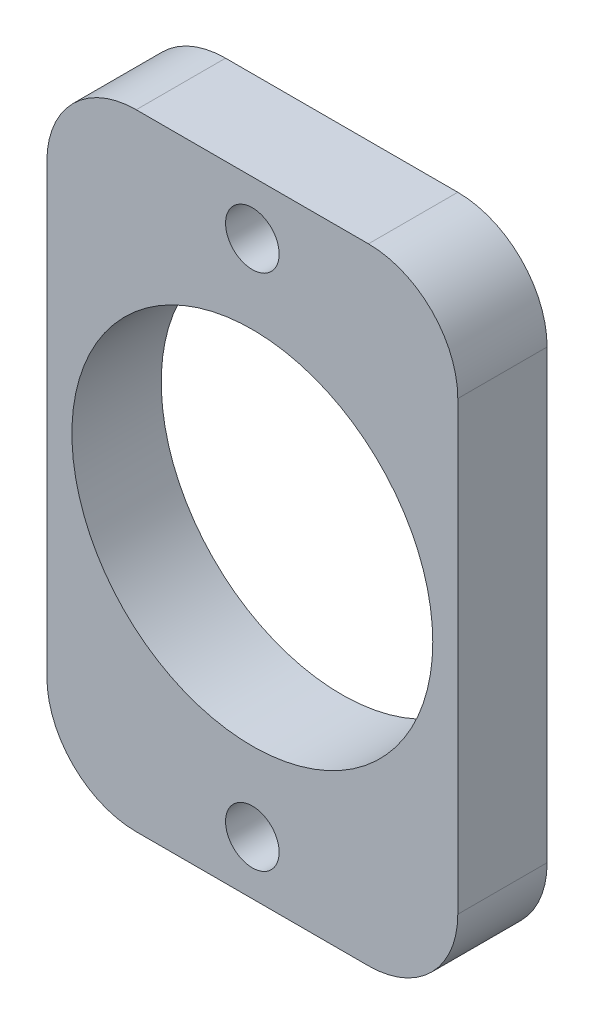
ISO-10303-21;
HEADER;
FILE_DESCRIPTION(('STEP AP214'),'2;1');
FILE_NAME('part.step','',(''),(''),'','','');
FILE_SCHEMA(('AUTOMOTIVE_DESIGN { 1 0 10303 214 1 1 1 1 }'));
ENDSEC;
DATA;
#1=APPLICATION_CONTEXT('core data for automotive mechanical design processes');
#2=APPLICATION_PROTOCOL_DEFINITION('international standard','automotive_design',2000,#1);
#3=PRODUCT_CONTEXT('',#1,'mechanical');
#4=PRODUCT('Part','Part','',(#3));
#5=PRODUCT_RELATED_PRODUCT_CATEGORY('part','',(#4));
#6=PRODUCT_DEFINITION_FORMATION('','',#4);
#7=PRODUCT_DEFINITION_CONTEXT('part definition',#1,'design');
#8=PRODUCT_DEFINITION('design','',#6,#7);
#9=PRODUCT_DEFINITION_SHAPE('','',#8);
#10=(LENGTH_UNIT() NAMED_UNIT(*) SI_UNIT(.MILLI.,.METRE.));
#11=(NAMED_UNIT(*) PLANE_ANGLE_UNIT() SI_UNIT($,.RADIAN.));
#12=(NAMED_UNIT(*) SI_UNIT($,.STERADIAN.) SOLID_ANGLE_UNIT());
#13=UNCERTAINTY_MEASURE_WITH_UNIT(LENGTH_MEASURE(1.E-05),#10,'distance_accuracy_value','');
#14=(GEOMETRIC_REPRESENTATION_CONTEXT(3) GLOBAL_UNCERTAINTY_ASSIGNED_CONTEXT((#13)) GLOBAL_UNIT_ASSIGNED_CONTEXT((#10,
#11,#12)) REPRESENTATION_CONTEXT('',''));
#15=CARTESIAN_POINT('',(0.,0.,0.));
#16=DIRECTION('',(0.,0.,1.));
#17=DIRECTION('',(1.,0.,0.));
#18=AXIS2_PLACEMENT_3D('',#15,#16,#17);
#19=CARTESIAN_POINT('',(0.,0.,5.));
#20=DIRECTION('',(0.,0.,1.));
#21=DIRECTION('',(1.,0.,0.));
#22=AXIS2_PLACEMENT_3D('',#19,#20,#21);
#23=PLANE('',#22);
#24=CARTESIAN_POINT('',(0.,14.5,5.));
#25=DIRECTION('',(0.,0.,1.));
#26=DIRECTION('',(1.,0.,0.));
#27=AXIS2_PLACEMENT_3D('',#24,#25,#26);
#28=CIRCLE('',#27,1.5);
#29=CARTESIAN_POINT('',(1.5,14.5,5.));
#30=VERTEX_POINT('',#29);
#31=EDGE_CURVE('E186',#30,#30,#28,.T.);
#32=ORIENTED_EDGE('',*,*,#31,.F.);
#33=EDGE_LOOP('',(#32));
#34=FACE_BOUND('',#33,.T.);
#35=DIRECTION('',(1.,0.,0.));
#36=VECTOR('',#35,1.);
#37=CARTESIAN_POINT('',(-11.5,-17.5,5.));
#38=LINE('',#37,#36);
#39=CARTESIAN_POINT('',(-6.5,-17.5,5.));
#40=VERTEX_POINT('',#39);
#41=CARTESIAN_POINT('',(6.5,-17.5,5.));
#42=VERTEX_POINT('',#41);
#43=EDGE_CURVE('E172',#40,#42,#38,.T.);
#44=ORIENTED_EDGE('',*,*,#43,.T.);
#45=CARTESIAN_POINT('',(6.5,-12.5,5.));
#46=DIRECTION('',(0.,0.,1.));
#47=DIRECTION('',(1.,0.,0.));
#48=AXIS2_PLACEMENT_3D('',#45,#46,#47);
#49=CIRCLE('',#48,5.);
#50=CARTESIAN_POINT('',(11.5,-12.5,5.));
#51=VERTEX_POINT('',#50);
#52=EDGE_CURVE('E150',#42,#51,#49,.T.);
#53=ORIENTED_EDGE('',*,*,#52,.T.);
#54=DIRECTION('',(0.,1.,0.));
#55=VECTOR('',#54,1.);
#56=CARTESIAN_POINT('',(11.5,17.5,5.));
#57=LINE('',#56,#55);
#58=CARTESIAN_POINT('',(11.5,12.5,5.));
#59=VERTEX_POINT('',#58);
#60=EDGE_CURVE('E120',#51,#59,#57,.T.);
#61=ORIENTED_EDGE('',*,*,#60,.T.);
#62=CARTESIAN_POINT('',(6.5,12.5,5.));
#63=DIRECTION('',(0.,0.,1.));
#64=DIRECTION('',(1.,0.,0.));
#65=AXIS2_PLACEMENT_3D('',#62,#63,#64);
#66=CIRCLE('',#65,5.);
#67=CARTESIAN_POINT('',(6.5,17.5,5.));
#68=VERTEX_POINT('',#67);
#69=EDGE_CURVE('E56',#59,#68,#66,.T.);
#70=ORIENTED_EDGE('',*,*,#69,.T.);
#71=DIRECTION('',(-1.,0.,0.));
#72=VECTOR('',#71,1.);
#73=CARTESIAN_POINT('',(-11.5,17.5,5.));
#74=LINE('',#73,#72);
#75=CARTESIAN_POINT('',(-6.5,17.5,5.));
#76=VERTEX_POINT('',#75);
#77=EDGE_CURVE('E136',#68,#76,#74,.T.);
#78=ORIENTED_EDGE('',*,*,#77,.T.);
#79=CARTESIAN_POINT('',(-6.5,12.5,5.));
#80=DIRECTION('',(0.,0.,1.));
#81=DIRECTION('',(1.,0.,0.));
#82=AXIS2_PLACEMENT_3D('',#79,#80,#81);
#83=CIRCLE('',#82,5.);
#84=CARTESIAN_POINT('',(-11.5,12.5,5.));
#85=VERTEX_POINT('',#84);
#86=EDGE_CURVE('E146',#76,#85,#83,.T.);
#87=ORIENTED_EDGE('',*,*,#86,.T.);
#88=DIRECTION('',(0.,-1.,0.));
#89=VECTOR('',#88,1.);
#90=CARTESIAN_POINT('',(-11.5,17.5,5.));
#91=LINE('',#90,#89);
#92=CARTESIAN_POINT('',(-11.5,-12.5,5.));
#93=VERTEX_POINT('',#92);
#94=EDGE_CURVE('E130',#85,#93,#91,.T.);
#95=ORIENTED_EDGE('',*,*,#94,.T.);
#96=CARTESIAN_POINT('',(-6.5,-12.5,5.));
#97=DIRECTION('',(0.,0.,1.));
#98=DIRECTION('',(1.,0.,0.));
#99=AXIS2_PLACEMENT_3D('',#96,#97,#98);
#100=CIRCLE('',#99,5.);
#101=EDGE_CURVE('E148',#93,#40,#100,.T.);
#102=ORIENTED_EDGE('',*,*,#101,.T.);
#103=EDGE_LOOP('',(#44,#53,#61,#70,#78,#87,#95,#102));
#104=FACE_BOUND('',#103,.T.);
#105=CARTESIAN_POINT('',(0.,0.,5.));
#106=DIRECTION('',(0.,0.,1.));
#107=DIRECTION('',(1.,0.,0.));
#108=AXIS2_PLACEMENT_3D('',#105,#106,#107);
#109=CIRCLE('',#108,10.1);
#110=CARTESIAN_POINT('',(10.1,0.,5.));
#111=VERTEX_POINT('',#110);
#112=EDGE_CURVE('E181',#111,#111,#109,.T.);
#113=ORIENTED_EDGE('',*,*,#112,.F.);
#114=EDGE_LOOP('',(#113));
#115=FACE_BOUND('',#114,.T.);
#116=CARTESIAN_POINT('',(0.,-14.5,5.));
#117=DIRECTION('',(0.,0.,1.));
#118=DIRECTION('',(1.,0.,0.));
#119=AXIS2_PLACEMENT_3D('',#116,#117,#118);
#120=CIRCLE('',#119,1.5);
#121=CARTESIAN_POINT('',(1.5,-14.5,5.));
#122=VERTEX_POINT('',#121);
#123=EDGE_CURVE('E191',#122,#122,#120,.T.);
#124=ORIENTED_EDGE('',*,*,#123,.F.);
#125=EDGE_LOOP('',(#124));
#126=FACE_BOUND('',#125,.T.);
#127=ADVANCED_FACE('F36',(#34,#104,#115,#126),#23,.T.);
#128=CARTESIAN_POINT('',(0.,0.,0.));
#129=DIRECTION('',(0.,0.,1.));
#130=DIRECTION('',(1.,0.,0.));
#131=AXIS2_PLACEMENT_3D('',#128,#129,#130);
#132=PLANE('',#131);
#133=DIRECTION('',(0.,1.,0.));
#134=VECTOR('',#133,1.);
#135=CARTESIAN_POINT('',(11.5,17.5,0.));
#136=LINE('',#135,#134);
#137=CARTESIAN_POINT('',(11.5,-12.5,0.));
#138=VERTEX_POINT('',#137);
#139=CARTESIAN_POINT('',(11.5,12.5,0.));
#140=VERTEX_POINT('',#139);
#141=EDGE_CURVE('E118',#138,#140,#136,.T.);
#142=ORIENTED_EDGE('',*,*,#141,.F.);
#143=CARTESIAN_POINT('',(6.5,-12.5,0.));
#144=DIRECTION('',(0.,0.,1.));
#145=DIRECTION('',(1.,0.,0.));
#146=AXIS2_PLACEMENT_3D('',#143,#144,#145);
#147=CIRCLE('',#146,5.);
#148=CARTESIAN_POINT('',(6.5,-17.5,0.));
#149=VERTEX_POINT('',#148);
#150=EDGE_CURVE('E101',#138,#149,#147,.F.);
#151=ORIENTED_EDGE('',*,*,#150,.T.);
#152=DIRECTION('',(1.,0.,0.));
#153=VECTOR('',#152,1.);
#154=CARTESIAN_POINT('',(-11.5,-17.5,0.));
#155=LINE('',#154,#153);
#156=CARTESIAN_POINT('',(-6.5,-17.5,0.));
#157=VERTEX_POINT('',#156);
#158=EDGE_CURVE('E128',#157,#149,#155,.T.);
#159=ORIENTED_EDGE('',*,*,#158,.F.);
#160=CARTESIAN_POINT('',(-6.5,-12.5,0.));
#161=DIRECTION('',(0.,0.,1.));
#162=DIRECTION('',(1.,0.,0.));
#163=AXIS2_PLACEMENT_3D('',#160,#161,#162);
#164=CIRCLE('',#163,5.);
#165=CARTESIAN_POINT('',(-11.5,-12.5,0.));
#166=VERTEX_POINT('',#165);
#167=EDGE_CURVE('E112',#157,#166,#164,.F.);
#168=ORIENTED_EDGE('',*,*,#167,.T.);
#169=DIRECTION('',(0.,-1.,0.));
#170=VECTOR('',#169,1.);
#171=CARTESIAN_POINT('',(-11.5,17.5,0.));
#172=LINE('',#171,#170);
#173=CARTESIAN_POINT('',(-11.5,12.5,0.));
#174=VERTEX_POINT('',#173);
#175=EDGE_CURVE('E132',#174,#166,#172,.T.);
#176=ORIENTED_EDGE('',*,*,#175,.F.);
#177=CARTESIAN_POINT('',(-6.5,12.5,0.));
#178=DIRECTION('',(0.,0.,1.));
#179=DIRECTION('',(1.,0.,0.));
#180=AXIS2_PLACEMENT_3D('',#177,#178,#179);
#181=CIRCLE('',#180,5.);
#182=CARTESIAN_POINT('',(-6.5,17.5,0.));
#183=VERTEX_POINT('',#182);
#184=EDGE_CURVE('E139',#174,#183,#181,.F.);
#185=ORIENTED_EDGE('',*,*,#184,.T.);
#186=DIRECTION('',(-1.,0.,0.));
#187=VECTOR('',#186,1.);
#188=CARTESIAN_POINT('',(-11.5,17.5,0.));
#189=LINE('',#188,#187);
#190=CARTESIAN_POINT('',(6.5,17.5,0.));
#191=VERTEX_POINT('',#190);
#192=EDGE_CURVE('E127',#191,#183,#189,.T.);
#193=ORIENTED_EDGE('',*,*,#192,.F.);
#194=CARTESIAN_POINT('',(6.5,12.5,0.));
#195=DIRECTION('',(0.,0.,1.));
#196=DIRECTION('',(1.,0.,0.));
#197=AXIS2_PLACEMENT_3D('',#194,#195,#196);
#198=CIRCLE('',#197,5.);
#199=EDGE_CURVE('E121',#191,#140,#198,.F.);
#200=ORIENTED_EDGE('',*,*,#199,.T.);
#201=EDGE_LOOP('',(#142,#151,#159,#168,#176,#185,#193,#200));
#202=FACE_BOUND('',#201,.T.);
#203=CARTESIAN_POINT('',(0.,0.,0.));
#204=DIRECTION('',(0.,0.,1.));
#205=DIRECTION('',(1.,0.,0.));
#206=AXIS2_PLACEMENT_3D('',#203,#204,#205);
#207=CIRCLE('',#206,10.1);
#208=CARTESIAN_POINT('',(10.1,0.,0.));
#209=VERTEX_POINT('',#208);
#210=EDGE_CURVE('E177',#209,#209,#207,.T.);
#211=ORIENTED_EDGE('',*,*,#210,.T.);
#212=EDGE_LOOP('',(#211));
#213=FACE_BOUND('',#212,.T.);
#214=CARTESIAN_POINT('',(0.,14.5,0.));
#215=DIRECTION('',(0.,0.,1.));
#216=DIRECTION('',(1.,0.,0.));
#217=AXIS2_PLACEMENT_3D('',#214,#215,#216);
#218=CIRCLE('',#217,1.5);
#219=CARTESIAN_POINT('',(1.5,14.5,0.));
#220=VERTEX_POINT('',#219);
#221=EDGE_CURVE('E188',#220,#220,#218,.T.);
#222=ORIENTED_EDGE('',*,*,#221,.T.);
#223=EDGE_LOOP('',(#222));
#224=FACE_BOUND('',#223,.T.);
#225=CARTESIAN_POINT('',(0.,-14.5,0.));
#226=DIRECTION('',(0.,0.,1.));
#227=DIRECTION('',(1.,0.,0.));
#228=AXIS2_PLACEMENT_3D('',#225,#226,#227);
#229=CIRCLE('',#228,1.5);
#230=CARTESIAN_POINT('',(1.5,-14.5,0.));
#231=VERTEX_POINT('',#230);
#232=EDGE_CURVE('E194',#231,#231,#229,.T.);
#233=ORIENTED_EDGE('',*,*,#232,.T.);
#234=EDGE_LOOP('',(#233));
#235=FACE_BOUND('',#234,.T.);
#236=ADVANCED_FACE('F124',(#202,#213,#224,#235),#132,.F.);
#237=CARTESIAN_POINT('',(-11.5,17.5,5.));
#238=DIRECTION('',(1.,0.,0.));
#239=DIRECTION('',(0.,0.,-1.));
#240=AXIS2_PLACEMENT_3D('',#237,#238,#239);
#241=PLANE('',#240);
#242=ORIENTED_EDGE('',*,*,#175,.T.);
#243=DIRECTION('',(0.,0.,-1.));
#244=VECTOR('',#243,1.);
#245=CARTESIAN_POINT('',(-11.5,-12.5,5.));
#246=LINE('',#245,#244);
#247=EDGE_CURVE('E155',#166,#93,#246,.F.);
#248=ORIENTED_EDGE('',*,*,#247,.T.);
#249=ORIENTED_EDGE('',*,*,#94,.F.);
#250=DIRECTION('',(0.,0.,-1.));
#251=VECTOR('',#250,1.);
#252=CARTESIAN_POINT('',(-11.5,12.5,5.));
#253=LINE('',#252,#251);
#254=EDGE_CURVE('E152',#85,#174,#253,.T.);
#255=ORIENTED_EDGE('',*,*,#254,.T.);
#256=EDGE_LOOP('',(#242,#248,#249,#255));
#257=FACE_BOUND('',#256,.T.);
#258=ADVANCED_FACE('F168',(#257),#241,.F.);
#259=CARTESIAN_POINT('',(-11.5,-17.5,5.));
#260=DIRECTION('',(0.,1.,0.));
#261=DIRECTION('',(-1.,0.,0.));
#262=AXIS2_PLACEMENT_3D('',#259,#260,#261);
#263=PLANE('',#262);
#264=ORIENTED_EDGE('',*,*,#158,.T.);
#265=DIRECTION('',(0.,0.,-1.));
#266=VECTOR('',#265,1.);
#267=CARTESIAN_POINT('',(6.5,-17.5,5.));
#268=LINE('',#267,#266);
#269=EDGE_CURVE('E106',#149,#42,#268,.F.);
#270=ORIENTED_EDGE('',*,*,#269,.T.);
#271=ORIENTED_EDGE('',*,*,#43,.F.);
#272=DIRECTION('',(0.,0.,-1.));
#273=VECTOR('',#272,1.);
#274=CARTESIAN_POINT('',(-6.5,-17.5,5.));
#275=LINE('',#274,#273);
#276=EDGE_CURVE('E111',#40,#157,#275,.T.);
#277=ORIENTED_EDGE('',*,*,#276,.T.);
#278=EDGE_LOOP('',(#264,#270,#271,#277));
#279=FACE_BOUND('',#278,.T.);
#280=ADVANCED_FACE('F219',(#279),#263,.F.);
#281=CARTESIAN_POINT('',(11.5,17.5,5.));
#282=DIRECTION('',(-1.,0.,0.));
#283=DIRECTION('',(0.,0.,1.));
#284=AXIS2_PLACEMENT_3D('',#281,#282,#283);
#285=PLANE('',#284);
#286=ORIENTED_EDGE('',*,*,#60,.F.);
#287=DIRECTION('',(0.,0.,-1.));
#288=VECTOR('',#287,1.);
#289=CARTESIAN_POINT('',(11.5,-12.5,5.));
#290=LINE('',#289,#288);
#291=EDGE_CURVE('E105',#51,#138,#290,.T.);
#292=ORIENTED_EDGE('',*,*,#291,.T.);
#293=ORIENTED_EDGE('',*,*,#141,.T.);
#294=DIRECTION('',(0.,0.,-1.));
#295=VECTOR('',#294,1.);
#296=CARTESIAN_POINT('',(11.5,12.5,5.));
#297=LINE('',#296,#295);
#298=EDGE_CURVE('E122',#140,#59,#297,.F.);
#299=ORIENTED_EDGE('',*,*,#298,.T.);
#300=EDGE_LOOP('',(#286,#292,#293,#299));
#301=FACE_BOUND('',#300,.T.);
#302=ADVANCED_FACE('F117',(#301),#285,.F.);
#303=CARTESIAN_POINT('',(-11.5,17.5,5.));
#304=DIRECTION('',(0.,-1.,0.));
#305=DIRECTION('',(1.,0.,0.));
#306=AXIS2_PLACEMENT_3D('',#303,#304,#305);
#307=PLANE('',#306);
#308=ORIENTED_EDGE('',*,*,#192,.T.);
#309=DIRECTION('',(0.,0.,-1.));
#310=VECTOR('',#309,1.);
#311=CARTESIAN_POINT('',(-6.5,17.5,5.));
#312=LINE('',#311,#310);
#313=EDGE_CURVE('E11',#183,#76,#312,.F.);
#314=ORIENTED_EDGE('',*,*,#313,.T.);
#315=ORIENTED_EDGE('',*,*,#77,.F.);
#316=DIRECTION('',(0.,0.,-1.));
#317=VECTOR('',#316,1.);
#318=CARTESIAN_POINT('',(6.5,17.5,5.));
#319=LINE('',#318,#317);
#320=EDGE_CURVE('E44',#68,#191,#319,.T.);
#321=ORIENTED_EDGE('',*,*,#320,.T.);
#322=EDGE_LOOP('',(#308,#314,#315,#321));
#323=FACE_BOUND('',#322,.T.);
#324=ADVANCED_FACE('F158',(#323),#307,.F.);
#325=CARTESIAN_POINT('',(0.,0.,5.));
#326=DIRECTION('',(0.,0.,-1.));
#327=DIRECTION('',(-1.,0.,0.));
#328=AXIS2_PLACEMENT_3D('',#325,#326,#327);
#329=CYLINDRICAL_SURFACE('',#328,10.1);
#330=ORIENTED_EDGE('',*,*,#112,.T.);
#331=EDGE_LOOP('',(#330));
#332=FACE_BOUND('',#331,.T.);
#333=ORIENTED_EDGE('',*,*,#210,.F.);
#334=EDGE_LOOP('',(#333));
#335=FACE_BOUND('',#334,.T.);
#336=ADVANCED_FACE('F212',(#332,#335),#329,.F.);
#337=CARTESIAN_POINT('',(0.,14.5,5.));
#338=DIRECTION('',(0.,0.,-1.));
#339=DIRECTION('',(-1.,0.,0.));
#340=AXIS2_PLACEMENT_3D('',#337,#338,#339);
#341=CYLINDRICAL_SURFACE('',#340,1.5);
#342=ORIENTED_EDGE('',*,*,#31,.T.);
#343=EDGE_LOOP('',(#342));
#344=FACE_BOUND('',#343,.T.);
#345=ORIENTED_EDGE('',*,*,#221,.F.);
#346=EDGE_LOOP('',(#345));
#347=FACE_BOUND('',#346,.T.);
#348=ADVANCED_FACE('F300',(#344,#347),#341,.F.);
#349=CARTESIAN_POINT('',(0.,-14.5,5.));
#350=DIRECTION('',(0.,0.,-1.));
#351=DIRECTION('',(-1.,0.,0.));
#352=AXIS2_PLACEMENT_3D('',#349,#350,#351);
#353=CYLINDRICAL_SURFACE('',#352,1.5);
#354=ORIENTED_EDGE('',*,*,#123,.T.);
#355=EDGE_LOOP('',(#354));
#356=FACE_BOUND('',#355,.T.);
#357=ORIENTED_EDGE('',*,*,#232,.F.);
#358=EDGE_LOOP('',(#357));
#359=FACE_BOUND('',#358,.T.);
#360=ADVANCED_FACE('F200',(#356,#359),#353,.F.);
#361=CARTESIAN_POINT('',(6.5,-12.5,5.));
#362=DIRECTION('',(0.,0.,-1.));
#363=DIRECTION('',(-1.,0.,0.));
#364=AXIS2_PLACEMENT_3D('',#361,#362,#363);
#365=CYLINDRICAL_SURFACE('',#364,5.);
#366=ORIENTED_EDGE('',*,*,#52,.F.);
#367=ORIENTED_EDGE('',*,*,#269,.F.);
#368=ORIENTED_EDGE('',*,*,#150,.F.);
#369=ORIENTED_EDGE('',*,*,#291,.F.);
#370=EDGE_LOOP('',(#366,#367,#368,#369));
#371=FACE_BOUND('',#370,.T.);
#372=ADVANCED_FACE('F104',(#371),#365,.T.);
#373=CARTESIAN_POINT('',(-6.5,-12.5,5.));
#374=DIRECTION('',(0.,0.,-1.));
#375=DIRECTION('',(-1.,0.,0.));
#376=AXIS2_PLACEMENT_3D('',#373,#374,#375);
#377=CYLINDRICAL_SURFACE('',#376,5.);
#378=ORIENTED_EDGE('',*,*,#101,.F.);
#379=ORIENTED_EDGE('',*,*,#247,.F.);
#380=ORIENTED_EDGE('',*,*,#167,.F.);
#381=ORIENTED_EDGE('',*,*,#276,.F.);
#382=EDGE_LOOP('',(#378,#379,#380,#381));
#383=FACE_BOUND('',#382,.T.);
#384=ADVANCED_FACE('F227',(#383),#377,.T.);
#385=CARTESIAN_POINT('',(-6.5,12.5,5.));
#386=DIRECTION('',(0.,0.,-1.));
#387=DIRECTION('',(-1.,0.,0.));
#388=AXIS2_PLACEMENT_3D('',#385,#386,#387);
#389=CYLINDRICAL_SURFACE('',#388,5.);
#390=ORIENTED_EDGE('',*,*,#86,.F.);
#391=ORIENTED_EDGE('',*,*,#313,.F.);
#392=ORIENTED_EDGE('',*,*,#184,.F.);
#393=ORIENTED_EDGE('',*,*,#254,.F.);
#394=EDGE_LOOP('',(#390,#391,#392,#393));
#395=FACE_BOUND('',#394,.T.);
#396=ADVANCED_FACE('F165',(#395),#389,.T.);
#397=CARTESIAN_POINT('',(6.5,12.5,5.));
#398=DIRECTION('',(0.,0.,-1.));
#399=DIRECTION('',(-1.,0.,0.));
#400=AXIS2_PLACEMENT_3D('',#397,#398,#399);
#401=CYLINDRICAL_SURFACE('',#400,5.);
#402=ORIENTED_EDGE('',*,*,#69,.F.);
#403=ORIENTED_EDGE('',*,*,#298,.F.);
#404=ORIENTED_EDGE('',*,*,#199,.F.);
#405=ORIENTED_EDGE('',*,*,#320,.F.);
#406=EDGE_LOOP('',(#402,#403,#404,#405));
#407=FACE_BOUND('',#406,.T.);
#408=ADVANCED_FACE('F38',(#407),#401,.T.);
#409=CLOSED_SHELL('',(#127,#236,#258,#280,#302,#324,#336,#348,#360,#372,#384,#396,#408));
#410=MANIFOLD_SOLID_BREP('B2',#409);
#411=ADVANCED_BREP_SHAPE_REPRESENTATION('',(#18,#410),#14);
#412=SHAPE_DEFINITION_REPRESENTATION(#9,#411);
ENDSEC;
END-ISO-10303-21;
